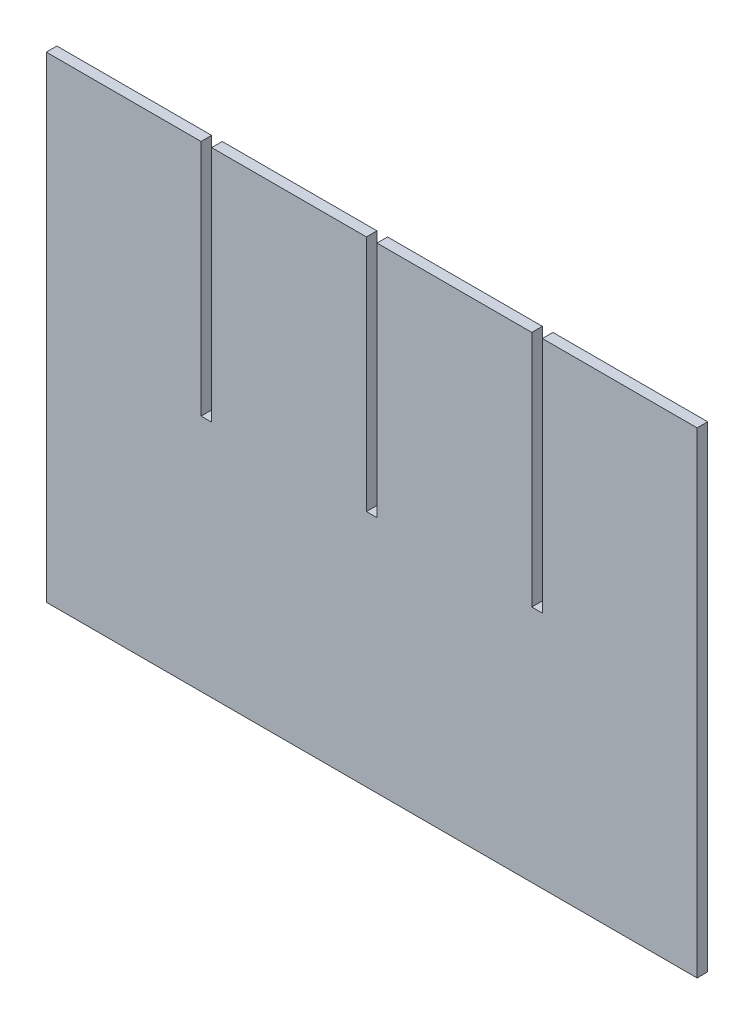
ISO-10303-21;
HEADER;
FILE_DESCRIPTION(('STEP AP214'),'2;1');
FILE_NAME('part.step','',(''),(''),'','','');
FILE_SCHEMA(('AUTOMOTIVE_DESIGN { 1 0 10303 214 1 1 1 1 }'));
ENDSEC;
DATA;
#1=APPLICATION_CONTEXT('core data for automotive mechanical design processes');
#2=APPLICATION_PROTOCOL_DEFINITION('international standard','automotive_design',2000,#1);
#3=PRODUCT_CONTEXT('',#1,'mechanical');
#4=PRODUCT('Part','Part','',(#3));
#5=PRODUCT_RELATED_PRODUCT_CATEGORY('part','',(#4));
#6=PRODUCT_DEFINITION_FORMATION('','',#4);
#7=PRODUCT_DEFINITION_CONTEXT('part definition',#1,'design');
#8=PRODUCT_DEFINITION('design','',#6,#7);
#9=PRODUCT_DEFINITION_SHAPE('','',#8);
#10=(LENGTH_UNIT() NAMED_UNIT(*) SI_UNIT(.MILLI.,.METRE.));
#11=(NAMED_UNIT(*) PLANE_ANGLE_UNIT() SI_UNIT($,.RADIAN.));
#12=(NAMED_UNIT(*) SI_UNIT($,.STERADIAN.) SOLID_ANGLE_UNIT());
#13=UNCERTAINTY_MEASURE_WITH_UNIT(LENGTH_MEASURE(1.E-05),#10,'distance_accuracy_value','');
#14=(GEOMETRIC_REPRESENTATION_CONTEXT(3) GLOBAL_UNCERTAINTY_ASSIGNED_CONTEXT((#13)) GLOBAL_UNIT_ASSIGNED_CONTEXT((#10,
#11,#12)) REPRESENTATION_CONTEXT('',''));
#15=CARTESIAN_POINT('',(0.,0.,0.));
#16=DIRECTION('',(0.,0.,1.));
#17=DIRECTION('',(1.,0.,0.));
#18=AXIS2_PLACEMENT_3D('',#15,#16,#17);
#19=CARTESIAN_POINT('',(218.948,0.,3.556));
#20=DIRECTION('',(0.,1.,0.));
#21=DIRECTION('',(0.,0.,1.));
#22=AXIS2_PLACEMENT_3D('',#19,#20,#21);
#23=PLANE('',#22);
#24=DIRECTION('',(1.,0.,0.));
#25=VECTOR('',#24,1.);
#26=CARTESIAN_POINT('',(218.948,0.,0.));
#27=LINE('',#26,#25);
#28=CARTESIAN_POINT('',(0.,0.,0.));
#29=VERTEX_POINT('',#28);
#30=CARTESIAN_POINT('',(218.948,0.,0.));
#31=VERTEX_POINT('',#30);
#32=EDGE_CURVE('E177',#29,#31,#27,.T.);
#33=ORIENTED_EDGE('',*,*,#32,.T.);
#34=DIRECTION('',(0.,0.,-1.));
#35=VECTOR('',#34,1.);
#36=CARTESIAN_POINT('',(218.948,0.,3.556));
#37=LINE('',#36,#35);
#38=CARTESIAN_POINT('',(218.948,0.,3.556));
#39=VERTEX_POINT('',#38);
#40=EDGE_CURVE('E11',#39,#31,#37,.T.);
#41=ORIENTED_EDGE('',*,*,#40,.F.);
#42=DIRECTION('',(1.,0.,0.));
#43=VECTOR('',#42,1.);
#44=CARTESIAN_POINT('',(218.948,0.,3.556));
#45=LINE('',#44,#43);
#46=CARTESIAN_POINT('',(0.,0.,3.556));
#47=VERTEX_POINT('',#46);
#48=EDGE_CURVE('E207',#47,#39,#45,.T.);
#49=ORIENTED_EDGE('',*,*,#48,.F.);
#50=DIRECTION('',(0.,0.,-1.));
#51=VECTOR('',#50,1.);
#52=CARTESIAN_POINT('',(0.,0.,3.556));
#53=LINE('',#52,#51);
#54=EDGE_CURVE('E173',#47,#29,#53,.T.);
#55=ORIENTED_EDGE('',*,*,#54,.T.);
#56=EDGE_LOOP('',(#33,#41,#49,#55));
#57=FACE_BOUND('',#56,.T.);
#58=ADVANCED_FACE('F33',(#57),#23,.F.);
#59=CARTESIAN_POINT('',(218.948,160.274,3.556));
#60=DIRECTION('',(-1.,0.,0.));
#61=DIRECTION('',(0.,0.,1.));
#62=AXIS2_PLACEMENT_3D('',#59,#60,#61);
#63=PLANE('',#62);
#64=DIRECTION('',(0.,1.,0.));
#65=VECTOR('',#64,1.);
#66=CARTESIAN_POINT('',(218.948,160.274,0.));
#67=LINE('',#66,#65);
#68=CARTESIAN_POINT('',(218.948,160.274,0.));
#69=VERTEX_POINT('',#68);
#70=EDGE_CURVE('E180',#31,#69,#67,.T.);
#71=ORIENTED_EDGE('',*,*,#70,.T.);
#72=DIRECTION('',(0.,0.,-1.));
#73=VECTOR('',#72,1.);
#74=CARTESIAN_POINT('',(218.948,160.274,3.556));
#75=LINE('',#74,#73);
#76=CARTESIAN_POINT('',(218.948,160.274,3.556));
#77=VERTEX_POINT('',#76);
#78=EDGE_CURVE('E41',#77,#69,#75,.T.);
#79=ORIENTED_EDGE('',*,*,#78,.F.);
#80=DIRECTION('',(0.,1.,0.));
#81=VECTOR('',#80,1.);
#82=CARTESIAN_POINT('',(218.948,160.274,3.556));
#83=LINE('',#82,#81);
#84=EDGE_CURVE('E116',#39,#77,#83,.T.);
#85=ORIENTED_EDGE('',*,*,#84,.F.);
#86=ORIENTED_EDGE('',*,*,#40,.T.);
#87=EDGE_LOOP('',(#71,#79,#85,#86));
#88=FACE_BOUND('',#87,.T.);
#89=ADVANCED_FACE('F305',(#88),#63,.F.);
#90=CARTESIAN_POINT('',(166.878,160.274,3.556));
#91=DIRECTION('',(0.,-1.,0.));
#92=DIRECTION('',(0.,0.,-1.));
#93=AXIS2_PLACEMENT_3D('',#90,#91,#92);
#94=PLANE('',#93);
#95=DIRECTION('',(-1.,0.,0.));
#96=VECTOR('',#95,1.);
#97=CARTESIAN_POINT('',(166.878,160.274,0.));
#98=LINE('',#97,#96);
#99=CARTESIAN_POINT('',(166.878,160.274,0.));
#100=VERTEX_POINT('',#99);
#101=EDGE_CURVE('E182',#69,#100,#98,.T.);
#102=ORIENTED_EDGE('',*,*,#101,.T.);
#103=DIRECTION('',(0.,0.,-1.));
#104=VECTOR('',#103,1.);
#105=CARTESIAN_POINT('',(166.878,160.274,3.556));
#106=LINE('',#105,#104);
#107=CARTESIAN_POINT('',(166.878,160.274,3.556));
#108=VERTEX_POINT('',#107);
#109=EDGE_CURVE('E238',#108,#100,#106,.T.);
#110=ORIENTED_EDGE('',*,*,#109,.F.);
#111=DIRECTION('',(-1.,0.,0.));
#112=VECTOR('',#111,1.);
#113=CARTESIAN_POINT('',(166.878,160.274,3.556));
#114=LINE('',#113,#112);
#115=EDGE_CURVE('E246',#77,#108,#114,.T.);
#116=ORIENTED_EDGE('',*,*,#115,.F.);
#117=ORIENTED_EDGE('',*,*,#78,.T.);
#118=EDGE_LOOP('',(#102,#110,#116,#117));
#119=FACE_BOUND('',#118,.T.);
#120=ADVANCED_FACE('F244',(#119),#94,.F.);
#121=CARTESIAN_POINT('',(166.878,80.264,3.556));
#122=DIRECTION('',(1.,0.,0.));
#123=DIRECTION('',(0.,0.,-1.));
#124=AXIS2_PLACEMENT_3D('',#121,#122,#123);
#125=PLANE('',#124);
#126=DIRECTION('',(0.,-1.,0.));
#127=VECTOR('',#126,1.);
#128=CARTESIAN_POINT('',(166.878,80.264,0.));
#129=LINE('',#128,#127);
#130=CARTESIAN_POINT('',(166.878,80.264,0.));
#131=VERTEX_POINT('',#130);
#132=EDGE_CURVE('E184',#100,#131,#129,.T.);
#133=ORIENTED_EDGE('',*,*,#132,.T.);
#134=DIRECTION('',(0.,0.,-1.));
#135=VECTOR('',#134,1.);
#136=CARTESIAN_POINT('',(166.878,80.264,3.556));
#137=LINE('',#136,#135);
#138=CARTESIAN_POINT('',(166.878,80.264,3.556));
#139=VERTEX_POINT('',#138);
#140=EDGE_CURVE('E235',#139,#131,#137,.T.);
#141=ORIENTED_EDGE('',*,*,#140,.F.);
#142=DIRECTION('',(0.,-1.,0.));
#143=VECTOR('',#142,1.);
#144=CARTESIAN_POINT('',(166.878,80.264,3.556));
#145=LINE('',#144,#143);
#146=EDGE_CURVE('E264',#108,#139,#145,.T.);
#147=ORIENTED_EDGE('',*,*,#146,.F.);
#148=ORIENTED_EDGE('',*,*,#109,.T.);
#149=EDGE_LOOP('',(#133,#141,#147,#148));
#150=FACE_BOUND('',#149,.T.);
#151=ADVANCED_FACE('F255',(#150),#125,.F.);
#152=CARTESIAN_POINT('',(163.322,80.264,3.556));
#153=DIRECTION('',(0.,-1.,0.));
#154=DIRECTION('',(0.,0.,-1.));
#155=AXIS2_PLACEMENT_3D('',#152,#153,#154);
#156=PLANE('',#155);
#157=DIRECTION('',(-1.,0.,0.));
#158=VECTOR('',#157,1.);
#159=CARTESIAN_POINT('',(163.322,80.264,0.));
#160=LINE('',#159,#158);
#161=CARTESIAN_POINT('',(163.322,80.264,0.));
#162=VERTEX_POINT('',#161);
#163=EDGE_CURVE('E186',#131,#162,#160,.T.);
#164=ORIENTED_EDGE('',*,*,#163,.T.);
#165=DIRECTION('',(0.,0.,-1.));
#166=VECTOR('',#165,1.);
#167=CARTESIAN_POINT('',(163.322,80.264,3.556));
#168=LINE('',#167,#166);
#169=CARTESIAN_POINT('',(163.322,80.264,3.556));
#170=VERTEX_POINT('',#169);
#171=EDGE_CURVE('E232',#170,#162,#168,.T.);
#172=ORIENTED_EDGE('',*,*,#171,.F.);
#173=DIRECTION('',(-1.,0.,0.));
#174=VECTOR('',#173,1.);
#175=CARTESIAN_POINT('',(163.322,80.264,3.556));
#176=LINE('',#175,#174);
#177=EDGE_CURVE('E261',#139,#170,#176,.T.);
#178=ORIENTED_EDGE('',*,*,#177,.F.);
#179=ORIENTED_EDGE('',*,*,#140,.T.);
#180=EDGE_LOOP('',(#164,#172,#178,#179));
#181=FACE_BOUND('',#180,.T.);
#182=ADVANCED_FACE('F259',(#181),#156,.F.);
#183=CARTESIAN_POINT('',(163.322,160.274,3.556));
#184=DIRECTION('',(-1.,0.,0.));
#185=DIRECTION('',(0.,-1.,0.));
#186=AXIS2_PLACEMENT_3D('',#183,#184,#185);
#187=PLANE('',#186);
#188=DIRECTION('',(0.,1.,0.));
#189=VECTOR('',#188,1.);
#190=CARTESIAN_POINT('',(163.322,160.274,0.));
#191=LINE('',#190,#189);
#192=CARTESIAN_POINT('',(163.322,160.274,0.));
#193=VERTEX_POINT('',#192);
#194=EDGE_CURVE('E188',#162,#193,#191,.T.);
#195=ORIENTED_EDGE('',*,*,#194,.T.);
#196=DIRECTION('',(0.,0.,-1.));
#197=VECTOR('',#196,1.);
#198=CARTESIAN_POINT('',(163.322,160.274,3.556));
#199=LINE('',#198,#197);
#200=CARTESIAN_POINT('',(163.322,160.274,3.556));
#201=VERTEX_POINT('',#200);
#202=EDGE_CURVE('E229',#201,#193,#199,.T.);
#203=ORIENTED_EDGE('',*,*,#202,.F.);
#204=DIRECTION('',(0.,1.,0.));
#205=VECTOR('',#204,1.);
#206=CARTESIAN_POINT('',(163.322,160.274,3.556));
#207=LINE('',#206,#205);
#208=EDGE_CURVE('E263',#170,#201,#207,.T.);
#209=ORIENTED_EDGE('',*,*,#208,.F.);
#210=ORIENTED_EDGE('',*,*,#171,.T.);
#211=EDGE_LOOP('',(#195,#203,#209,#210));
#212=FACE_BOUND('',#211,.T.);
#213=ADVANCED_FACE('F318',(#212),#187,.F.);
#214=CARTESIAN_POINT('',(111.252,160.274,3.556));
#215=DIRECTION('',(0.,-1.,0.));
#216=DIRECTION('',(0.,0.,-1.));
#217=AXIS2_PLACEMENT_3D('',#214,#215,#216);
#218=PLANE('',#217);
#219=DIRECTION('',(-1.,0.,0.));
#220=VECTOR('',#219,1.);
#221=CARTESIAN_POINT('',(111.252,160.274,0.));
#222=LINE('',#221,#220);
#223=CARTESIAN_POINT('',(111.252,160.274,0.));
#224=VERTEX_POINT('',#223);
#225=EDGE_CURVE('E190',#193,#224,#222,.T.);
#226=ORIENTED_EDGE('',*,*,#225,.T.);
#227=DIRECTION('',(0.,0.,-1.));
#228=VECTOR('',#227,1.);
#229=CARTESIAN_POINT('',(111.252,160.274,3.556));
#230=LINE('',#229,#228);
#231=CARTESIAN_POINT('',(111.252,160.274,3.556));
#232=VERTEX_POINT('',#231);
#233=EDGE_CURVE('E226',#232,#224,#230,.T.);
#234=ORIENTED_EDGE('',*,*,#233,.F.);
#235=DIRECTION('',(-1.,0.,0.));
#236=VECTOR('',#235,1.);
#237=CARTESIAN_POINT('',(111.252,160.274,3.556));
#238=LINE('',#237,#236);
#239=EDGE_CURVE('E266',#201,#232,#238,.T.);
#240=ORIENTED_EDGE('',*,*,#239,.F.);
#241=ORIENTED_EDGE('',*,*,#202,.T.);
#242=EDGE_LOOP('',(#226,#234,#240,#241));
#243=FACE_BOUND('',#242,.T.);
#244=ADVANCED_FACE('F321',(#243),#218,.F.);
#245=CARTESIAN_POINT('',(111.252,80.264,3.556));
#246=DIRECTION('',(1.,0.,0.));
#247=DIRECTION('',(0.,0.,-1.));
#248=AXIS2_PLACEMENT_3D('',#245,#246,#247);
#249=PLANE('',#248);
#250=DIRECTION('',(0.,-1.,0.));
#251=VECTOR('',#250,1.);
#252=CARTESIAN_POINT('',(111.252,80.264,0.));
#253=LINE('',#252,#251);
#254=CARTESIAN_POINT('',(111.252,80.264,0.));
#255=VERTEX_POINT('',#254);
#256=EDGE_CURVE('E192',#224,#255,#253,.T.);
#257=ORIENTED_EDGE('',*,*,#256,.T.);
#258=DIRECTION('',(0.,0.,-1.));
#259=VECTOR('',#258,1.);
#260=CARTESIAN_POINT('',(111.252,80.264,3.556));
#261=LINE('',#260,#259);
#262=CARTESIAN_POINT('',(111.252,80.264,3.556));
#263=VERTEX_POINT('',#262);
#264=EDGE_CURVE('E223',#263,#255,#261,.T.);
#265=ORIENTED_EDGE('',*,*,#264,.F.);
#266=DIRECTION('',(0.,-1.,0.));
#267=VECTOR('',#266,1.);
#268=CARTESIAN_POINT('',(111.252,80.264,3.556));
#269=LINE('',#268,#267);
#270=EDGE_CURVE('E272',#232,#263,#269,.T.);
#271=ORIENTED_EDGE('',*,*,#270,.F.);
#272=ORIENTED_EDGE('',*,*,#233,.T.);
#273=EDGE_LOOP('',(#257,#265,#271,#272));
#274=FACE_BOUND('',#273,.T.);
#275=ADVANCED_FACE('F325',(#274),#249,.F.);
#276=CARTESIAN_POINT('',(107.696,80.264,3.556));
#277=DIRECTION('',(0.,-1.,0.));
#278=DIRECTION('',(0.,0.,-1.));
#279=AXIS2_PLACEMENT_3D('',#276,#277,#278);
#280=PLANE('',#279);
#281=DIRECTION('',(-1.,0.,0.));
#282=VECTOR('',#281,1.);
#283=CARTESIAN_POINT('',(107.696,80.264,0.));
#284=LINE('',#283,#282);
#285=CARTESIAN_POINT('',(107.696,80.264,0.));
#286=VERTEX_POINT('',#285);
#287=EDGE_CURVE('E194',#255,#286,#284,.T.);
#288=ORIENTED_EDGE('',*,*,#287,.T.);
#289=DIRECTION('',(0.,0.,-1.));
#290=VECTOR('',#289,1.);
#291=CARTESIAN_POINT('',(107.696,80.264,3.556));
#292=LINE('',#291,#290);
#293=CARTESIAN_POINT('',(107.696,80.264,3.556));
#294=VERTEX_POINT('',#293);
#295=EDGE_CURVE('E220',#294,#286,#292,.T.);
#296=ORIENTED_EDGE('',*,*,#295,.F.);
#297=DIRECTION('',(-1.,0.,0.));
#298=VECTOR('',#297,1.);
#299=CARTESIAN_POINT('',(107.696,80.264,3.556));
#300=LINE('',#299,#298);
#301=EDGE_CURVE('E274',#263,#294,#300,.T.);
#302=ORIENTED_EDGE('',*,*,#301,.F.);
#303=ORIENTED_EDGE('',*,*,#264,.T.);
#304=EDGE_LOOP('',(#288,#296,#302,#303));
#305=FACE_BOUND('',#304,.T.);
#306=ADVANCED_FACE('F329',(#305),#280,.F.);
#307=CARTESIAN_POINT('',(107.696,160.274,3.556));
#308=DIRECTION('',(-1.,0.,0.));
#309=DIRECTION('',(0.,-1.,0.));
#310=AXIS2_PLACEMENT_3D('',#307,#308,#309);
#311=PLANE('',#310);
#312=DIRECTION('',(0.,1.,0.));
#313=VECTOR('',#312,1.);
#314=CARTESIAN_POINT('',(107.696,160.274,0.));
#315=LINE('',#314,#313);
#316=CARTESIAN_POINT('',(107.696,160.274,0.));
#317=VERTEX_POINT('',#316);
#318=EDGE_CURVE('E196',#286,#317,#315,.T.);
#319=ORIENTED_EDGE('',*,*,#318,.T.);
#320=DIRECTION('',(0.,0.,-1.));
#321=VECTOR('',#320,1.);
#322=CARTESIAN_POINT('',(107.696,160.274,3.556));
#323=LINE('',#322,#321);
#324=CARTESIAN_POINT('',(107.696,160.274,3.556));
#325=VERTEX_POINT('',#324);
#326=EDGE_CURVE('E217',#325,#317,#323,.T.);
#327=ORIENTED_EDGE('',*,*,#326,.F.);
#328=DIRECTION('',(0.,1.,0.));
#329=VECTOR('',#328,1.);
#330=CARTESIAN_POINT('',(107.696,160.274,3.556));
#331=LINE('',#330,#329);
#332=EDGE_CURVE('E276',#294,#325,#331,.T.);
#333=ORIENTED_EDGE('',*,*,#332,.F.);
#334=ORIENTED_EDGE('',*,*,#295,.T.);
#335=EDGE_LOOP('',(#319,#327,#333,#334));
#336=FACE_BOUND('',#335,.T.);
#337=ADVANCED_FACE('F333',(#336),#311,.F.);
#338=CARTESIAN_POINT('',(55.626,160.274,3.556));
#339=DIRECTION('',(0.,-1.,0.));
#340=DIRECTION('',(0.,0.,-1.));
#341=AXIS2_PLACEMENT_3D('',#338,#339,#340);
#342=PLANE('',#341);
#343=DIRECTION('',(-1.,0.,0.));
#344=VECTOR('',#343,1.);
#345=CARTESIAN_POINT('',(55.626,160.274,0.));
#346=LINE('',#345,#344);
#347=CARTESIAN_POINT('',(55.626,160.274,0.));
#348=VERTEX_POINT('',#347);
#349=EDGE_CURVE('E198',#317,#348,#346,.T.);
#350=ORIENTED_EDGE('',*,*,#349,.T.);
#351=DIRECTION('',(0.,0.,-1.));
#352=VECTOR('',#351,1.);
#353=CARTESIAN_POINT('',(55.626,160.274,3.556));
#354=LINE('',#353,#352);
#355=CARTESIAN_POINT('',(55.626,160.274,3.556));
#356=VERTEX_POINT('',#355);
#357=EDGE_CURVE('E214',#356,#348,#354,.T.);
#358=ORIENTED_EDGE('',*,*,#357,.F.);
#359=DIRECTION('',(-1.,0.,0.));
#360=VECTOR('',#359,1.);
#361=CARTESIAN_POINT('',(55.626,160.274,3.556));
#362=LINE('',#361,#360);
#363=EDGE_CURVE('E278',#325,#356,#362,.T.);
#364=ORIENTED_EDGE('',*,*,#363,.F.);
#365=ORIENTED_EDGE('',*,*,#326,.T.);
#366=EDGE_LOOP('',(#350,#358,#364,#365));
#367=FACE_BOUND('',#366,.T.);
#368=ADVANCED_FACE('F337',(#367),#342,.F.);
#369=CARTESIAN_POINT('',(55.626,80.264,3.556));
#370=DIRECTION('',(1.,0.,0.));
#371=DIRECTION('',(0.,0.,-1.));
#372=AXIS2_PLACEMENT_3D('',#369,#370,#371);
#373=PLANE('',#372);
#374=DIRECTION('',(0.,-1.,0.));
#375=VECTOR('',#374,1.);
#376=CARTESIAN_POINT('',(55.626,80.264,0.));
#377=LINE('',#376,#375);
#378=CARTESIAN_POINT('',(55.626,80.264,0.));
#379=VERTEX_POINT('',#378);
#380=EDGE_CURVE('E200',#348,#379,#377,.T.);
#381=ORIENTED_EDGE('',*,*,#380,.T.);
#382=DIRECTION('',(0.,0.,-1.));
#383=VECTOR('',#382,1.);
#384=CARTESIAN_POINT('',(55.626,80.264,3.556));
#385=LINE('',#384,#383);
#386=CARTESIAN_POINT('',(55.626,80.264,3.556));
#387=VERTEX_POINT('',#386);
#388=EDGE_CURVE('E211',#387,#379,#385,.T.);
#389=ORIENTED_EDGE('',*,*,#388,.F.);
#390=DIRECTION('',(0.,-1.,0.));
#391=VECTOR('',#390,1.);
#392=CARTESIAN_POINT('',(55.626,80.264,3.556));
#393=LINE('',#392,#391);
#394=EDGE_CURVE('E280',#356,#387,#393,.T.);
#395=ORIENTED_EDGE('',*,*,#394,.F.);
#396=ORIENTED_EDGE('',*,*,#357,.T.);
#397=EDGE_LOOP('',(#381,#389,#395,#396));
#398=FACE_BOUND('',#397,.T.);
#399=ADVANCED_FACE('F286',(#398),#373,.F.);
#400=CARTESIAN_POINT('',(52.07,80.264,3.556));
#401=DIRECTION('',(0.,-1.,0.));
#402=DIRECTION('',(0.,0.,-1.));
#403=AXIS2_PLACEMENT_3D('',#400,#401,#402);
#404=PLANE('',#403);
#405=DIRECTION('',(-1.,0.,0.));
#406=VECTOR('',#405,1.);
#407=CARTESIAN_POINT('',(52.07,80.264,0.));
#408=LINE('',#407,#406);
#409=CARTESIAN_POINT('',(52.07,80.264,0.));
#410=VERTEX_POINT('',#409);
#411=EDGE_CURVE('E202',#379,#410,#408,.T.);
#412=ORIENTED_EDGE('',*,*,#411,.T.);
#413=DIRECTION('',(0.,0.,-1.));
#414=VECTOR('',#413,1.);
#415=CARTESIAN_POINT('',(52.07,80.264,3.556));
#416=LINE('',#415,#414);
#417=CARTESIAN_POINT('',(52.07,80.264,3.556));
#418=VERTEX_POINT('',#417);
#419=EDGE_CURVE('E168',#418,#410,#416,.T.);
#420=ORIENTED_EDGE('',*,*,#419,.F.);
#421=DIRECTION('',(-1.,0.,0.));
#422=VECTOR('',#421,1.);
#423=CARTESIAN_POINT('',(52.07,80.264,3.556));
#424=LINE('',#423,#422);
#425=EDGE_CURVE('E159',#387,#418,#424,.T.);
#426=ORIENTED_EDGE('',*,*,#425,.F.);
#427=ORIENTED_EDGE('',*,*,#388,.T.);
#428=EDGE_LOOP('',(#412,#420,#426,#427));
#429=FACE_BOUND('',#428,.T.);
#430=ADVANCED_FACE('F290',(#429),#404,.F.);
#431=CARTESIAN_POINT('',(52.07,160.274,3.556));
#432=DIRECTION('',(-1.,0.,0.));
#433=DIRECTION('',(0.,-1.,0.));
#434=AXIS2_PLACEMENT_3D('',#431,#432,#433);
#435=PLANE('',#434);
#436=DIRECTION('',(0.,1.,0.));
#437=VECTOR('',#436,1.);
#438=CARTESIAN_POINT('',(52.07,160.274,0.));
#439=LINE('',#438,#437);
#440=CARTESIAN_POINT('',(52.07,160.274,0.));
#441=VERTEX_POINT('',#440);
#442=EDGE_CURVE('E167',#410,#441,#439,.T.);
#443=ORIENTED_EDGE('',*,*,#442,.T.);
#444=DIRECTION('',(0.,0.,-1.));
#445=VECTOR('',#444,1.);
#446=CARTESIAN_POINT('',(52.07,160.274,3.556));
#447=LINE('',#446,#445);
#448=CARTESIAN_POINT('',(52.07,160.274,3.556));
#449=VERTEX_POINT('',#448);
#450=EDGE_CURVE('E164',#449,#441,#447,.T.);
#451=ORIENTED_EDGE('',*,*,#450,.F.);
#452=DIRECTION('',(0.,1.,0.));
#453=VECTOR('',#452,1.);
#454=CARTESIAN_POINT('',(52.07,160.274,3.556));
#455=LINE('',#454,#453);
#456=EDGE_CURVE('E153',#418,#449,#455,.T.);
#457=ORIENTED_EDGE('',*,*,#456,.F.);
#458=ORIENTED_EDGE('',*,*,#419,.T.);
#459=EDGE_LOOP('',(#443,#451,#457,#458));
#460=FACE_BOUND('',#459,.T.);
#461=ADVANCED_FACE('F165',(#460),#435,.F.);
#462=CARTESIAN_POINT('',(0.,160.274,3.556));
#463=DIRECTION('',(0.,-1.,0.));
#464=DIRECTION('',(0.,0.,-1.));
#465=AXIS2_PLACEMENT_3D('',#462,#463,#464);
#466=PLANE('',#465);
#467=DIRECTION('',(-1.,0.,0.));
#468=VECTOR('',#467,1.);
#469=CARTESIAN_POINT('',(0.,160.274,0.));
#470=LINE('',#469,#468);
#471=CARTESIAN_POINT('',(0.,160.274,0.));
#472=VERTEX_POINT('',#471);
#473=EDGE_CURVE('E102',#441,#472,#470,.T.);
#474=ORIENTED_EDGE('',*,*,#473,.T.);
#475=DIRECTION('',(0.,0.,-1.));
#476=VECTOR('',#475,1.);
#477=CARTESIAN_POINT('',(0.,160.274,3.556));
#478=LINE('',#477,#476);
#479=CARTESIAN_POINT('',(0.,160.274,3.556));
#480=VERTEX_POINT('',#479);
#481=EDGE_CURVE('E169',#480,#472,#478,.T.);
#482=ORIENTED_EDGE('',*,*,#481,.F.);
#483=DIRECTION('',(-1.,0.,0.));
#484=VECTOR('',#483,1.);
#485=CARTESIAN_POINT('',(0.,160.274,3.556));
#486=LINE('',#485,#484);
#487=EDGE_CURVE('E157',#449,#480,#486,.T.);
#488=ORIENTED_EDGE('',*,*,#487,.F.);
#489=ORIENTED_EDGE('',*,*,#450,.T.);
#490=EDGE_LOOP('',(#474,#482,#488,#489));
#491=FACE_BOUND('',#490,.T.);
#492=ADVANCED_FACE('F171',(#491),#466,.F.);
#493=CARTESIAN_POINT('',(0.,0.,3.556));
#494=DIRECTION('',(1.,0.,0.));
#495=DIRECTION('',(0.,0.,-1.));
#496=AXIS2_PLACEMENT_3D('',#493,#494,#495);
#497=PLANE('',#496);
#498=DIRECTION('',(0.,-1.,0.));
#499=VECTOR('',#498,1.);
#500=CARTESIAN_POINT('',(0.,0.,0.));
#501=LINE('',#500,#499);
#502=EDGE_CURVE('E108',#472,#29,#501,.T.);
#503=ORIENTED_EDGE('',*,*,#502,.T.);
#504=ORIENTED_EDGE('',*,*,#54,.F.);
#505=DIRECTION('',(0.,-1.,0.));
#506=VECTOR('',#505,1.);
#507=CARTESIAN_POINT('',(0.,0.,3.556));
#508=LINE('',#507,#506);
#509=EDGE_CURVE('E49',#480,#47,#508,.T.);
#510=ORIENTED_EDGE('',*,*,#509,.F.);
#511=ORIENTED_EDGE('',*,*,#481,.T.);
#512=EDGE_LOOP('',(#503,#504,#510,#511));
#513=FACE_BOUND('',#512,.T.);
#514=ADVANCED_FACE('F294',(#513),#497,.F.);
#515=CARTESIAN_POINT('',(0.,0.,3.556));
#516=DIRECTION('',(0.,0.,-1.));
#517=DIRECTION('',(-1.,0.,0.));
#518=AXIS2_PLACEMENT_3D('',#515,#516,#517);
#519=PLANE('',#518);
#520=ORIENTED_EDGE('',*,*,#48,.T.);
#521=ORIENTED_EDGE('',*,*,#84,.T.);
#522=ORIENTED_EDGE('',*,*,#115,.T.);
#523=ORIENTED_EDGE('',*,*,#146,.T.);
#524=ORIENTED_EDGE('',*,*,#177,.T.);
#525=ORIENTED_EDGE('',*,*,#208,.T.);
#526=ORIENTED_EDGE('',*,*,#239,.T.);
#527=ORIENTED_EDGE('',*,*,#270,.T.);
#528=ORIENTED_EDGE('',*,*,#301,.T.);
#529=ORIENTED_EDGE('',*,*,#332,.T.);
#530=ORIENTED_EDGE('',*,*,#363,.T.);
#531=ORIENTED_EDGE('',*,*,#394,.T.);
#532=ORIENTED_EDGE('',*,*,#425,.T.);
#533=ORIENTED_EDGE('',*,*,#456,.T.);
#534=ORIENTED_EDGE('',*,*,#487,.T.);
#535=ORIENTED_EDGE('',*,*,#509,.T.);
#536=EDGE_LOOP('',(#520,#521,#522,#523,#524,#525,#526,#527,#528,#529,#530,#531,#532,#533,#534,#535));
#537=FACE_BOUND('',#536,.T.);
#538=ADVANCED_FACE('F155',(#537),#519,.F.);
#539=CARTESIAN_POINT('',(0.,0.,0.));
#540=DIRECTION('',(0.,0.,-1.));
#541=DIRECTION('',(-1.,0.,0.));
#542=AXIS2_PLACEMENT_3D('',#539,#540,#541);
#543=PLANE('',#542);
#544=ORIENTED_EDGE('',*,*,#32,.F.);
#545=ORIENTED_EDGE('',*,*,#502,.F.);
#546=ORIENTED_EDGE('',*,*,#473,.F.);
#547=ORIENTED_EDGE('',*,*,#442,.F.);
#548=ORIENTED_EDGE('',*,*,#411,.F.);
#549=ORIENTED_EDGE('',*,*,#380,.F.);
#550=ORIENTED_EDGE('',*,*,#349,.F.);
#551=ORIENTED_EDGE('',*,*,#318,.F.);
#552=ORIENTED_EDGE('',*,*,#287,.F.);
#553=ORIENTED_EDGE('',*,*,#256,.F.);
#554=ORIENTED_EDGE('',*,*,#225,.F.);
#555=ORIENTED_EDGE('',*,*,#194,.F.);
#556=ORIENTED_EDGE('',*,*,#163,.F.);
#557=ORIENTED_EDGE('',*,*,#132,.F.);
#558=ORIENTED_EDGE('',*,*,#101,.F.);
#559=ORIENTED_EDGE('',*,*,#70,.F.);
#560=EDGE_LOOP('',(#544,#545,#546,#547,#548,#549,#550,#551,#552,#553,#554,#555,#556,#557,#558,#559));
#561=FACE_BOUND('',#560,.T.);
#562=ADVANCED_FACE('F250',(#561),#543,.T.);
#563=CLOSED_SHELL('',(#58,#89,#120,#151,#182,#213,#244,#275,#306,#337,#368,#399,#430,#461,#492,
#514,#538,#562));
#564=MANIFOLD_SOLID_BREP('B2',#563);
#565=ADVANCED_BREP_SHAPE_REPRESENTATION('',(#18,#564),#14);
#566=SHAPE_DEFINITION_REPRESENTATION(#9,#565);
ENDSEC;
END-ISO-10303-21;
